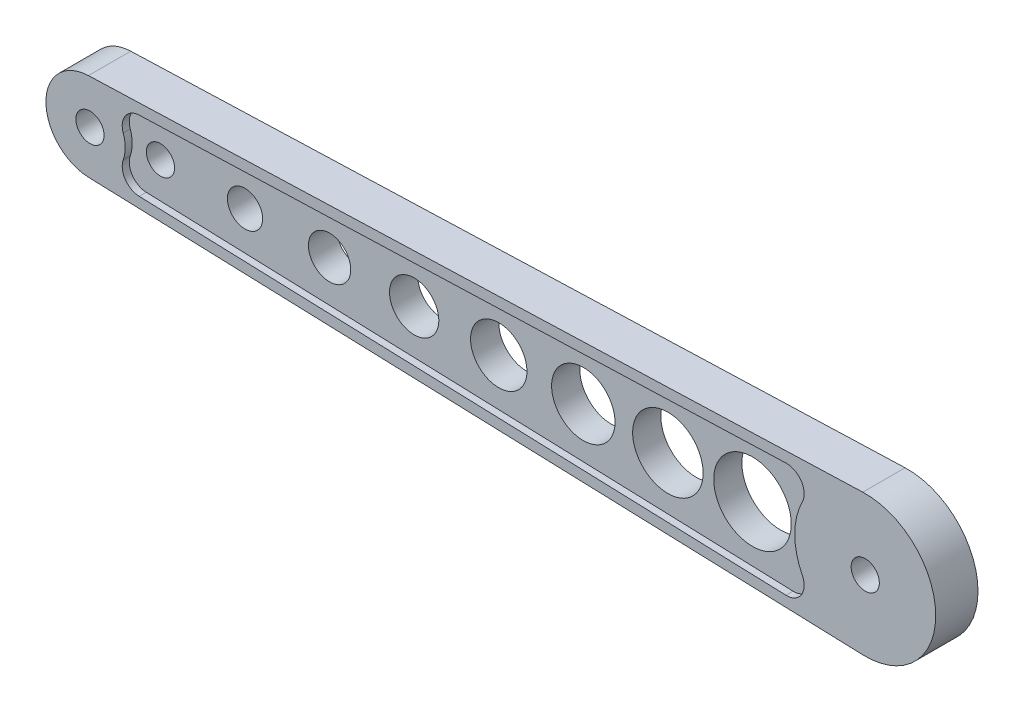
from build123d import *

# Parameters (mm, degrees)
IZIM1_R                     = 4
Y_KSEKLIK_EKSTR_ZYON1_DEPTH = 12
KES_EKSTR_ZYON1_START       = -2
KES_EKSTR_ZYON1_DEPTH       = 2
RADYUS2_R                   = 5
RADYUS3_R                   = 5
IZIM3_R                     = 4
IZIM3_R_2                   = 5
IZIM3_R_3                   = 6
IZIM3_R_4                   = 7
IZIM3_R_5                   = 8
IZIM3_R_6                   = 9
IZIM3_R_7                   = 10
IZIM3_R_8                   = 11
KES_EKSTR_ZYON3_DEPTH       = 10


with BuildPart() as part:
    # izim1 → Y_kseklik-Ekstr_zyon1 (new body)
    with BuildSketch(Plane.XY):
        with BuildLine():
            Line((-220.426136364, 12.4927342), (-0.681818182, 19.98837472))
            ThreePointArc((-0.681818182, 19.98837472), (20, 0), (-0.681818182, -19.98837472))
            Line((-0.681818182, -19.98837472), (-220.426136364, -12.4927342))
            ThreePointArc((-220.426136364, -12.4927342), (-232.5, 0), (-220.426136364, 12.4927342))
        make_face()
        with Locations((-220, 0)):
            Circle(IZIM1_R, mode=Mode.SUBTRACT)
        Circle(IZIM1_R, mode=Mode.SUBTRACT)
    extrude(amount=Y_KSEKLIK_EKSTR_ZYON1_DEPTH)

    # izim2 → Kes-Ekstr_zyon1 (cut)
    with BuildSketch(Plane.XY.offset(12).offset(KES_EKSTR_ZYON1_START)):
        with BuildLine():
            Line((-217.203179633, -9.600926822), (-11.109075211, -16.630948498))
            ThreePointArc((-11.109075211, -16.630948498), (-20, 0), (-11.109075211, 16.630948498))
            Line((-11.109075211, 16.630948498), (-217.203179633, 9.600926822))
            ThreePointArc((-217.203179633, 9.600926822), (-210, 0), (-217.203179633, -9.600926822))
        make_face()
    kes_ekstr_zyon1 = extrude(amount=KES_EKSTR_ZYON1_DEPTH, mode=Mode.SUBTRACT)

    # Radyus2
    radyus2_edges = [part.edges().sort_by_distance(p)[0] for p in [
        (-217.203179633, -9.600926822, 11),
        (-217.203179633, 9.600926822, 11),
        (-11.109075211, 16.630948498, 11),
        (-11.109075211, -16.630948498, 11),
    ]]
    fillet(radyus2_edges, radius=RADYUS2_R)

    # Aynalama2: Kes-Ekstr_zyon1 across plane
    add(kes_ekstr_zyon1.mirror(Plane.XY.offset(6)), mode=Mode.SUBTRACT)

    # Radyus3
    radyus3_edges = [part.edges().sort_by_distance(p)[0] for p in [
        (-217.203179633, 9.600926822, 1),
        (-217.203179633, -9.600926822, 1),
        (-11.109075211, -16.630948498, 1),
        (-11.109075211, 16.630948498, 1),
    ]]
    fillet(radyus3_edges, radius=RADYUS3_R)

    # izim3 → Kes-Ekstr_zyon3 (cut)
    with BuildSketch(Plane.XY.offset(10)):
        with Locations((-202, 0)):
            Circle(IZIM3_R)
        with Locations((-178, 0)):
            Circle(IZIM3_R_2)
        with Locations((-154, 0)):
            Circle(IZIM3_R_3)
        with Locations((-130, 0)):
            Circle(IZIM3_R_4)
        with Locations((-106, 0)):
            Circle(IZIM3_R_5)
        with Locations((-82, 0)):
            Circle(IZIM3_R_6)
        with Locations((-58, 0)):
            Circle(IZIM3_R_7)
        with Locations((-34, 0)):
            Circle(IZIM3_R_8)
    extrude(amount=-KES_EKSTR_ZYON3_DEPTH, mode=Mode.SUBTRACT)


solid = part.part
